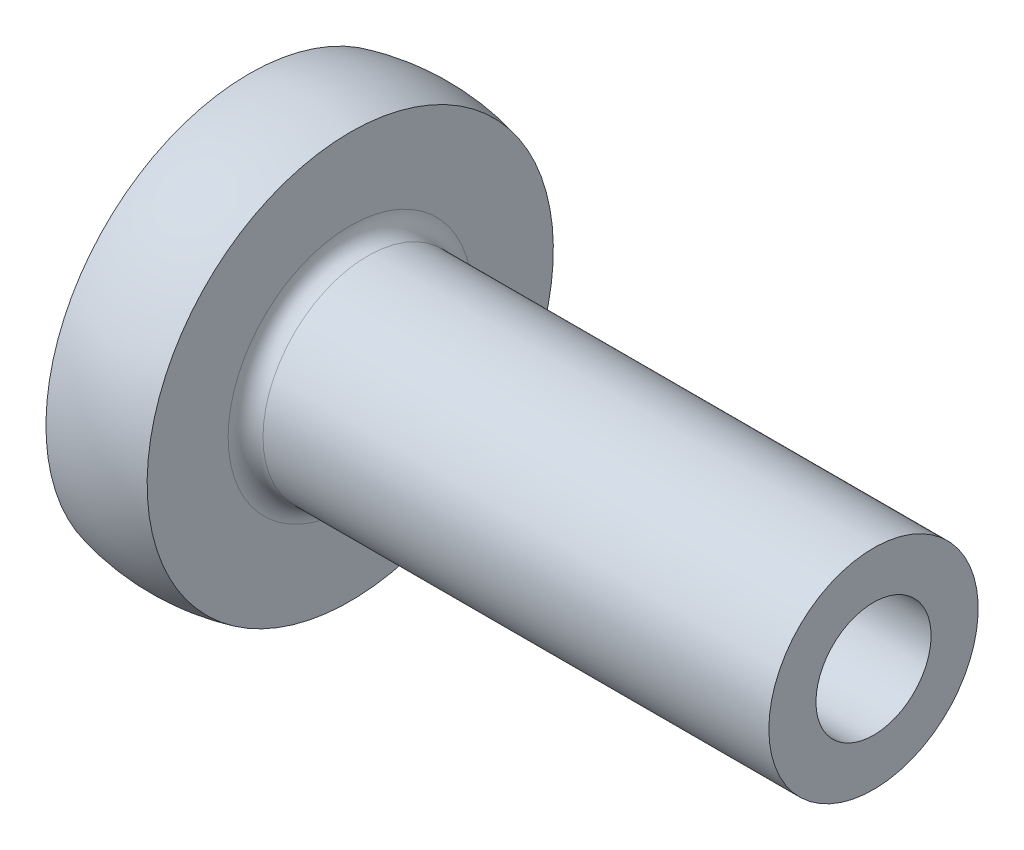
ISO-10303-21;
HEADER;
FILE_DESCRIPTION(('STEP AP214'),'2;1');
FILE_NAME('part.step','',(''),(''),'','','');
FILE_SCHEMA(('AUTOMOTIVE_DESIGN { 1 0 10303 214 1 1 1 1 }'));
ENDSEC;
DATA;
#1=APPLICATION_CONTEXT('core data for automotive mechanical design processes');
#2=APPLICATION_PROTOCOL_DEFINITION('international standard','automotive_design',2000,#1);
#3=PRODUCT_CONTEXT('',#1,'mechanical');
#4=PRODUCT('Part','Part','',(#3));
#5=PRODUCT_RELATED_PRODUCT_CATEGORY('part','',(#4));
#6=PRODUCT_DEFINITION_FORMATION('','',#4);
#7=PRODUCT_DEFINITION_CONTEXT('part definition',#1,'design');
#8=PRODUCT_DEFINITION('design','',#6,#7);
#9=PRODUCT_DEFINITION_SHAPE('','',#8);
#10=(LENGTH_UNIT() NAMED_UNIT(*) SI_UNIT(.MILLI.,.METRE.));
#11=(NAMED_UNIT(*) PLANE_ANGLE_UNIT() SI_UNIT($,.RADIAN.));
#12=(NAMED_UNIT(*) SI_UNIT($,.STERADIAN.) SOLID_ANGLE_UNIT());
#13=UNCERTAINTY_MEASURE_WITH_UNIT(LENGTH_MEASURE(1.E-05),#10,'distance_accuracy_value','');
#14=(GEOMETRIC_REPRESENTATION_CONTEXT(3) GLOBAL_UNCERTAINTY_ASSIGNED_CONTEXT((#13)) GLOBAL_UNIT_ASSIGNED_CONTEXT((#10,
#11,#12)) REPRESENTATION_CONTEXT('',''));
#15=CARTESIAN_POINT('',(0.,0.,0.));
#16=DIRECTION('',(0.,0.,1.));
#17=DIRECTION('',(1.,0.,0.));
#18=AXIS2_PLACEMENT_3D('',#15,#16,#17);
#19=CARTESIAN_POINT('',(1.94947441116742,0.,0.));
#20=DIRECTION('',(1.,0.,0.));
#21=DIRECTION('',(0.,0.,-1.));
#22=AXIS2_PLACEMENT_3D('',#19,#20,#21);
#23=CONICAL_SURFACE('',#22,0.,1.04719755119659);
#24=CARTESIAN_POINT('',(2.14,0.,0.));
#25=DIRECTION('',(-1.,0.,0.));
#26=DIRECTION('',(0.,0.,1.));
#27=AXIS2_PLACEMENT_3D('',#24,#25,#26);
#28=CIRCLE('',#27,0.33);
#29=CARTESIAN_POINT('',(2.14,0.,0.33));
#30=VERTEX_POINT('',#29);
#31=EDGE_CURVE('E90',#30,#30,#28,.T.);
#32=ORIENTED_EDGE('',*,*,#31,.F.);
#33=EDGE_LOOP('',(#32));
#34=FACE_BOUND('',#33,.T.);
#35=CARTESIAN_POINT('',(1.94947441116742,0.,0.));
#36=VERTEX_POINT('',#35);
#37=VERTEX_LOOP('',#36);
#38=FACE_BOUND('',#37,.T.);
#39=ADVANCED_FACE('F33',(#34,#38),#23,.F.);
#40=CARTESIAN_POINT('',(-2.31825396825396,0.,0.));
#41=DIRECTION('',(-1.,0.,0.));
#42=DIRECTION('',(0.,0.,1.));
#43=AXIS2_PLACEMENT_3D('',#40,#41,#42);
#44=CYLINDRICAL_SURFACE('',#43,0.33);
#45=CARTESIAN_POINT('',(3.58,0.,0.));
#46=DIRECTION('',(-1.,0.,0.));
#47=DIRECTION('',(0.,0.,1.));
#48=AXIS2_PLACEMENT_3D('',#45,#46,#47);
#49=CIRCLE('',#48,0.33);
#50=CARTESIAN_POINT('',(3.58,0.,0.33));
#51=VERTEX_POINT('',#50);
#52=EDGE_CURVE('E87',#51,#51,#49,.T.);
#53=ORIENTED_EDGE('',*,*,#52,.F.);
#54=EDGE_LOOP('',(#53));
#55=FACE_BOUND('',#54,.T.);
#56=ORIENTED_EDGE('',*,*,#31,.T.);
#57=EDGE_LOOP('',(#56));
#58=FACE_BOUND('',#57,.T.);
#59=ADVANCED_FACE('F44',(#55,#58),#44,.F.);
#60=CARTESIAN_POINT('',(3.58,0.33,0.));
#61=DIRECTION('',(-1.,0.,0.));
#62=DIRECTION('',(0.,0.,1.));
#63=AXIS2_PLACEMENT_3D('',#60,#61,#62);
#64=PLANE('',#63);
#65=CARTESIAN_POINT('',(3.58,0.,0.));
#66=DIRECTION('',(-1.,0.,0.));
#67=DIRECTION('',(0.,0.,1.));
#68=AXIS2_PLACEMENT_3D('',#65,#66,#67);
#69=CIRCLE('',#68,0.6);
#70=CARTESIAN_POINT('',(3.58,0.,0.6));
#71=VERTEX_POINT('',#70);
#72=EDGE_CURVE('E82',#71,#71,#69,.T.);
#73=ORIENTED_EDGE('',*,*,#72,.F.);
#74=EDGE_LOOP('',(#73));
#75=FACE_BOUND('',#74,.T.);
#76=ORIENTED_EDGE('',*,*,#52,.T.);
#77=EDGE_LOOP('',(#76));
#78=FACE_BOUND('',#77,.T.);
#79=ADVANCED_FACE('F49',(#75,#78),#64,.F.);
#80=CARTESIAN_POINT('',(-2.31825396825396,0.,0.));
#81=DIRECTION('',(-1.,0.,0.));
#82=DIRECTION('',(0.,0.,1.));
#83=AXIS2_PLACEMENT_3D('',#80,#81,#82);
#84=CYLINDRICAL_SURFACE('',#83,0.6);
#85=CARTESIAN_POINT('',(0.68,0.,0.));
#86=DIRECTION('',(-1.,0.,0.));
#87=DIRECTION('',(0.,0.,1.));
#88=AXIS2_PLACEMENT_3D('',#85,#86,#87);
#89=CIRCLE('',#88,0.6);
#90=CARTESIAN_POINT('',(0.68,0.,0.6));
#91=VERTEX_POINT('',#90);
#92=EDGE_CURVE('E11',#91,#91,#89,.F.);
#93=ORIENTED_EDGE('',*,*,#92,.T.);
#94=EDGE_LOOP('',(#93));
#95=FACE_BOUND('',#94,.T.);
#96=ORIENTED_EDGE('',*,*,#72,.T.);
#97=EDGE_LOOP('',(#96));
#98=FACE_BOUND('',#97,.T.);
#99=ADVANCED_FACE('F56',(#95,#98),#84,.T.);
#100=CARTESIAN_POINT('',(0.58,1.16443119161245,0.));
#101=DIRECTION('',(-1.,0.,0.));
#102=DIRECTION('',(0.,0.,1.));
#103=AXIS2_PLACEMENT_3D('',#100,#101,#102);
#104=PLANE('',#103);
#105=CARTESIAN_POINT('',(0.58,0.,0.));
#106=DIRECTION('',(-1.,0.,0.));
#107=DIRECTION('',(0.,0.,1.));
#108=AXIS2_PLACEMENT_3D('',#105,#106,#107);
#109=CIRCLE('',#108,0.7);
#110=CARTESIAN_POINT('',(0.58,0.,0.7));
#111=VERTEX_POINT('',#110);
#112=EDGE_CURVE('E40',#111,#111,#109,.T.);
#113=ORIENTED_EDGE('',*,*,#112,.T.);
#114=EDGE_LOOP('',(#113));
#115=FACE_BOUND('',#114,.T.);
#116=CARTESIAN_POINT('',(0.58,0.,0.));
#117=DIRECTION('',(-1.,0.,0.));
#118=DIRECTION('',(0.,0.,1.));
#119=AXIS2_PLACEMENT_3D('',#116,#117,#118);
#120=CIRCLE('',#119,1.16443119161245);
#121=CARTESIAN_POINT('',(0.58,1.16443119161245,0.));
#122=VERTEX_POINT('',#121);
#123=EDGE_CURVE('E79',#122,#122,#120,.T.);
#124=ORIENTED_EDGE('',*,*,#123,.F.);
#125=EDGE_LOOP('',(#124));
#126=FACE_BOUND('',#125,.T.);
#127=ADVANCED_FACE('F60',(#115,#126),#104,.F.);
#128=CARTESIAN_POINT('',(0.29,0.,0.));
#129=DIRECTION('',(-1.,0.,0.));
#130=DIRECTION('',(0.,1.,0.));
#131=AXIS2_PLACEMENT_3D('',#128,#129,#130);
#132=SPHERICAL_SURFACE('',#131,1.2);
#133=CARTESIAN_POINT('',(0.,0.,0.));
#134=DIRECTION('',(-1.,0.,0.));
#135=DIRECTION('',(0.,0.,1.));
#136=AXIS2_PLACEMENT_3D('',#133,#134,#135);
#137=CIRCLE('',#136,1.16443119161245);
#138=CARTESIAN_POINT('',(0.,1.16443119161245,0.));
#139=VERTEX_POINT('',#138);
#140=EDGE_CURVE('E78',#139,#139,#137,.T.);
#141=CARTESIAN_POINT('',(0.,1.16443119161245,0.));
#142=CARTESIAN_POINT('',(0.00592120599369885,1.16590586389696,0.));
#143=CARTESIAN_POINT('',(0.0118536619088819,1.16733536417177,0.));
#144=CARTESIAN_POINT('',(0.0237396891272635,1.17010370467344,0.));
#145=CARTESIAN_POINT('',(0.0296932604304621,1.17144254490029,0.));
#146=CARTESIAN_POINT('',(0.0416201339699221,1.17402924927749,0.));
#147=CARTESIAN_POINT('',(0.0475934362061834,1.17527711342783,0.));
#148=CARTESIAN_POINT('',(0.0595583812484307,1.17768157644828,0.));
#149=CARTESIAN_POINT('',(0.0655500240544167,1.17883817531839,0.));
#150=CARTESIAN_POINT('',(0.0775502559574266,1.18105983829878,0.));
#151=CARTESIAN_POINT('',(0.0835588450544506,1.18212490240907,0.));
#152=CARTESIAN_POINT('',(0.0955915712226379,1.18416324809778,0.));
#153=CARTESIAN_POINT('',(0.101615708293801,1.1851365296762,0.));
#154=CARTESIAN_POINT('',(0.113678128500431,1.18699108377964,0.));
#155=CARTESIAN_POINT('',(0.119716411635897,1.18787235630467,0.));
#156=CARTESIAN_POINT('',(0.131805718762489,1.18954268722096,0.));
#157=CARTESIAN_POINT('',(0.137856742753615,1.19033174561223,0.));
#158=CARTESIAN_POINT('',(0.149970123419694,1.19181746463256,0.));
#159=CARTESIAN_POINT('',(0.156032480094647,1.19251412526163,0.));
#160=CARTESIAN_POINT('',(0.168167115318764,1.1938148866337,0.));
#161=CARTESIAN_POINT('',(0.174239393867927,1.19441898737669,0.));
#162=CARTESIAN_POINT('',(0.186392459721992,1.19553448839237,0.));
#163=CARTESIAN_POINT('',(0.192473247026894,1.19604588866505,0.));
#164=CARTESIAN_POINT('',(0.204641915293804,1.19697586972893,0.));
#165=CARTESIAN_POINT('',(0.210729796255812,1.19739445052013,0.));
#166=CARTESIAN_POINT('',(0.222911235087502,1.19813869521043,0.));
#167=CARTESIAN_POINT('',(0.229004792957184,1.19846435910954,0.));
#168=CARTESIAN_POINT('',(0.241196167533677,1.19902269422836,0.));
#169=CARTESIAN_POINT('',(0.247293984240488,1.19925536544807,0.));
#170=CARTESIAN_POINT('',(0.259492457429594,1.1996276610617,0.));
#171=CARTESIAN_POINT('',(0.265593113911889,1.19976728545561,0.));
#172=CARTESIAN_POINT('',(0.277795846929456,1.19995345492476,0.));
#173=CARTESIAN_POINT('',(0.283897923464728,1.2,0.));
#174=CARTESIAN_POINT('',(0.296102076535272,1.2,0.));
#175=CARTESIAN_POINT('',(0.302204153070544,1.19995345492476,0.));
#176=CARTESIAN_POINT('',(0.314406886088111,1.19976728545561,0.));
#177=CARTESIAN_POINT('',(0.320507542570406,1.1996276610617,0.));
#178=CARTESIAN_POINT('',(0.332706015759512,1.19925536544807,0.));
#179=CARTESIAN_POINT('',(0.338803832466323,1.19902269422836,0.));
#180=CARTESIAN_POINT('',(0.350995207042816,1.19846435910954,0.));
#181=CARTESIAN_POINT('',(0.357088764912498,1.19813869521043,0.));
#182=CARTESIAN_POINT('',(0.369270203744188,1.19739445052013,0.));
#183=CARTESIAN_POINT('',(0.375358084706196,1.19697586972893,0.));
#184=CARTESIAN_POINT('',(0.387526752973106,1.19604588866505,0.));
#185=CARTESIAN_POINT('',(0.393607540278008,1.19553448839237,0.));
#186=CARTESIAN_POINT('',(0.405760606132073,1.19441898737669,0.));
#187=CARTESIAN_POINT('',(0.411832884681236,1.1938148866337,0.));
#188=CARTESIAN_POINT('',(0.423967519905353,1.19251412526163,0.));
#189=CARTESIAN_POINT('',(0.430029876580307,1.19181746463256,0.));
#190=CARTESIAN_POINT('',(0.442143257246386,1.19033174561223,0.));
#191=CARTESIAN_POINT('',(0.448194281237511,1.18954268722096,0.));
#192=CARTESIAN_POINT('',(0.460283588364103,1.18787235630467,0.));
#193=CARTESIAN_POINT('',(0.466321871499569,1.18699108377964,0.));
#194=CARTESIAN_POINT('',(0.478384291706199,1.1851365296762,0.));
#195=CARTESIAN_POINT('',(0.484408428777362,1.18416324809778,0.));
#196=CARTESIAN_POINT('',(0.49644115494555,1.18212490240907,0.));
#197=CARTESIAN_POINT('',(0.502449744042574,1.18105983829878,0.));
#198=CARTESIAN_POINT('',(0.514449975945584,1.17883817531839,0.));
#199=CARTESIAN_POINT('',(0.52044161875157,1.17768157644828,0.));
#200=CARTESIAN_POINT('',(0.532406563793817,1.17527711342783,0.));
#201=CARTESIAN_POINT('',(0.538379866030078,1.17402924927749,0.));
#202=CARTESIAN_POINT('',(0.550306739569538,1.17144254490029,0.));
#203=CARTESIAN_POINT('',(0.556260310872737,1.17010370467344,0.));
#204=CARTESIAN_POINT('',(0.568146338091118,1.16733536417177,0.));
#205=CARTESIAN_POINT('',(0.574078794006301,1.16590586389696,0.));
#206=CARTESIAN_POINT('',(0.58,1.16443119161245,0.));
#207=B_SPLINE_CURVE_WITH_KNOTS('',3,(#141,#142,#143,#144,#145,#146,#147,#148,#149,#150,#151,
#152,#153,#154,#155,#156,#157,#158,#159,#160,#161,#162,#163,#164,#165,#166,#167,#168,#169,#170,
#171,#172,#173,#174,#175,#176,#177,#178,#179,#180,#181,#182,#183,#184,#185,#186,#187,#188,#189,
#190,#191,#192,#193,#194,#195,#196,#197,#198,#199,#200,#201,#202,#203,#204,#205,#206),
.UNSPECIFIED.,.F.,.F.,(4,2,2,2,2,2,2,2,2,2,2,2,2,2,2,2,2,2,2,2,2,2,2,2,2,2,2,2,2,2,2,2,4),(0.,
0.0183060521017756,0.0366121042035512,0.0549181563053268,0.0732242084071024,0.091530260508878,
0.109836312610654,0.128142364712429,0.146448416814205,0.16475446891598,0.183060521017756,
0.201366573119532,0.219672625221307,0.237978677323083,0.256284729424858,0.274590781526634,
0.29289683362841,0.311202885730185,0.329508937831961,0.347814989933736,0.366121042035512,
0.384427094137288,0.402733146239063,0.421039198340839,0.439345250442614,0.45765130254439,
0.475957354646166,0.494263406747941,0.512569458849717,0.530875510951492,0.549181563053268,
0.567487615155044,0.585793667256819),.UNSPECIFIED.);
#208=EDGE_CURVE('BSEAM64',#139,#122,#207,.T.);
#209=ORIENTED_EDGE('',*,*,#140,.F.);
#210=ORIENTED_EDGE('',*,*,#123,.T.);
#211=ORIENTED_EDGE('',*,*,#208,.T.);
#212=ORIENTED_EDGE('',*,*,#208,.F.);
#213=EDGE_LOOP('',(#209,#211,#210,#212));
#214=FACE_BOUND('',#213,.T.);
#215=ADVANCED_FACE('F64',(#214),#132,.T.);
#216=CARTESIAN_POINT('',(0.,1.16443119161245,0.));
#217=DIRECTION('',(1.,0.,0.));
#218=DIRECTION('',(0.,0.,-1.));
#219=AXIS2_PLACEMENT_3D('',#216,#217,#218);
#220=PLANE('',#219);
#221=ORIENTED_EDGE('',*,*,#140,.T.);
#222=EDGE_LOOP('',(#221));
#223=FACE_BOUND('',#222,.T.);
#224=ADVANCED_FACE('F68',(#223),#220,.F.);
#225=CARTESIAN_POINT('',(0.68,0.,0.));
#226=DIRECTION('',(-1.,0.,0.));
#227=DIRECTION('',(0.,0.,1.));
#228=AXIS2_PLACEMENT_3D('',#225,#226,#227);
#229=TOROIDAL_SURFACE('',#228,0.7,0.1);
#230=ORIENTED_EDGE('',*,*,#92,.F.);
#231=EDGE_LOOP('',(#230));
#232=FACE_BOUND('',#231,.T.);
#233=ORIENTED_EDGE('',*,*,#112,.F.);
#234=EDGE_LOOP('',(#233));
#235=FACE_BOUND('',#234,.T.);
#236=ADVANCED_FACE('F35',(#232,#235),#229,.F.);
#237=CLOSED_SHELL('',(#39,#59,#79,#99,#127,#215,#224,#236));
#238=MANIFOLD_SOLID_BREP('B2',#237);
#239=ADVANCED_BREP_SHAPE_REPRESENTATION('',(#18,#238),#14);
#240=SHAPE_DEFINITION_REPRESENTATION(#9,#239);
ENDSEC;
END-ISO-10303-21;
